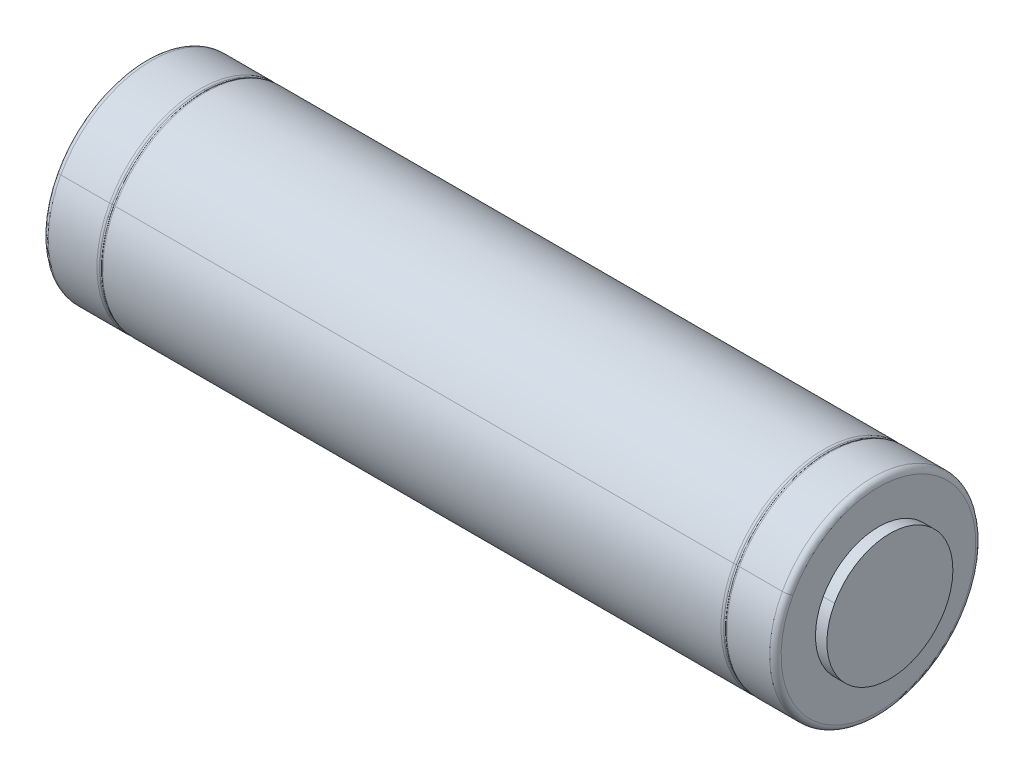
ISO-10303-21;
HEADER;
FILE_DESCRIPTION(('STEP AP214'),'2;1');
FILE_NAME('part.step','',(''),(''),'','','');
FILE_SCHEMA(('AUTOMOTIVE_DESIGN { 1 0 10303 214 1 1 1 1 }'));
ENDSEC;
DATA;
#1=APPLICATION_CONTEXT('core data for automotive mechanical design processes');
#2=APPLICATION_PROTOCOL_DEFINITION('international standard','automotive_design',2000,#1);
#3=PRODUCT_CONTEXT('',#1,'mechanical');
#4=PRODUCT('Part','Part','',(#3));
#5=PRODUCT_RELATED_PRODUCT_CATEGORY('part','',(#4));
#6=PRODUCT_DEFINITION_FORMATION('','',#4);
#7=PRODUCT_DEFINITION_CONTEXT('part definition',#1,'design');
#8=PRODUCT_DEFINITION('design','',#6,#7);
#9=PRODUCT_DEFINITION_SHAPE('','',#8);
#10=(LENGTH_UNIT() NAMED_UNIT(*) SI_UNIT(.MILLI.,.METRE.));
#11=(NAMED_UNIT(*) PLANE_ANGLE_UNIT() SI_UNIT($,.RADIAN.));
#12=(NAMED_UNIT(*) SI_UNIT($,.STERADIAN.) SOLID_ANGLE_UNIT());
#13=UNCERTAINTY_MEASURE_WITH_UNIT(LENGTH_MEASURE(1.E-05),#10,'distance_accuracy_value','');
#14=(GEOMETRIC_REPRESENTATION_CONTEXT(3) GLOBAL_UNCERTAINTY_ASSIGNED_CONTEXT((#13)) GLOBAL_UNIT_ASSIGNED_CONTEXT((#10,
#11,#12)) REPRESENTATION_CONTEXT('',''));
#15=CARTESIAN_POINT('',(0.,0.,0.));
#16=DIRECTION('',(0.,0.,1.));
#17=DIRECTION('',(1.,0.,0.));
#18=AXIS2_PLACEMENT_3D('',#15,#16,#17);
#19=CARTESIAN_POINT('',(0.,0.,0.));
#20=DIRECTION('',(-1.,0.,0.));
#21=DIRECTION('',(0.,0.,1.));
#22=AXIS2_PLACEMENT_3D('',#19,#20,#21);
#23=PLANE('',#22);
#24=CARTESIAN_POINT('',(0.,0.,0.));
#25=DIRECTION('',(-1.,0.,0.));
#26=DIRECTION('',(0.,-1.,0.));
#27=AXIS2_PLACEMENT_3D('',#24,#25,#26);
#28=CIRCLE('',#27,5.5);
#29=CARTESIAN_POINT('',(0.,2.63684046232,4.8267040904));
#30=VERTEX_POINT('',#29);
#31=CARTESIAN_POINT('',(0.,-2.63684046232,-4.8267040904));
#32=VERTEX_POINT('',#31);
#33=EDGE_CURVE('E311',#30,#32,#28,.T.);
#34=ORIENTED_EDGE('',*,*,#33,.F.);
#35=CARTESIAN_POINT('',(0.,0.,0.));
#36=DIRECTION('',(-1.,0.,0.));
#37=DIRECTION('',(0.,-1.,0.));
#38=AXIS2_PLACEMENT_3D('',#35,#36,#37);
#39=CIRCLE('',#38,5.5);
#40=EDGE_CURVE('E11',#32,#30,#39,.T.);
#41=ORIENTED_EDGE('',*,*,#40,.F.);
#42=EDGE_LOOP('',(#34,#41));
#43=FACE_BOUND('',#42,.T.);
#44=ADVANCED_FACE('F16',(#43),#23,.F.);
#45=CARTESIAN_POINT('',(-1.,0.,5.5));
#46=DIRECTION('',(-1.,0.,0.));
#47=DIRECTION('',(0.,0.,1.));
#48=AXIS2_PLACEMENT_3D('',#45,#46,#47);
#49=PLANE('',#48);
#50=CARTESIAN_POINT('',(-1.,0.,0.));
#51=DIRECTION('',(-1.,0.,0.));
#52=DIRECTION('',(0.,-1.,0.));
#53=AXIS2_PLACEMENT_3D('',#50,#51,#52);
#54=CIRCLE('',#53,5.5);
#55=CARTESIAN_POINT('',(-1.,-2.63684046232,-4.8267040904));
#56=VERTEX_POINT('',#55);
#57=CARTESIAN_POINT('',(-1.,2.63684046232,4.8267040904));
#58=VERTEX_POINT('',#57);
#59=EDGE_CURVE('E27',#56,#58,#54,.T.);
#60=ORIENTED_EDGE('',*,*,#59,.T.);
#61=CARTESIAN_POINT('',(-1.,0.,0.));
#62=DIRECTION('',(-1.,0.,0.));
#63=DIRECTION('',(0.,-1.,0.));
#64=AXIS2_PLACEMENT_3D('',#61,#62,#63);
#65=CIRCLE('',#64,5.5);
#66=EDGE_CURVE('E199',#58,#56,#65,.T.);
#67=ORIENTED_EDGE('',*,*,#66,.T.);
#68=EDGE_LOOP('',(#60,#67));
#69=FACE_BOUND('',#68,.T.);
#70=CARTESIAN_POINT('',(-1.,0.,0.));
#71=DIRECTION('',(-1.,0.,0.));
#72=DIRECTION('',(0.,-1.,0.));
#73=AXIS2_PLACEMENT_3D('',#70,#71,#72);
#74=CIRCLE('',#73,8.5);
#75=CARTESIAN_POINT('',(-1.,4.07511707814,7.45945177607));
#76=VERTEX_POINT('',#75);
#77=CARTESIAN_POINT('',(-1.,-4.07511707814,-7.45945177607));
#78=VERTEX_POINT('',#77);
#79=EDGE_CURVE('E249',#76,#78,#74,.T.);
#80=ORIENTED_EDGE('',*,*,#79,.F.);
#81=CARTESIAN_POINT('',(-1.,0.,0.));
#82=DIRECTION('',(-1.,0.,0.));
#83=DIRECTION('',(0.,-1.,0.));
#84=AXIS2_PLACEMENT_3D('',#81,#82,#83);
#85=CIRCLE('',#84,8.5);
#86=EDGE_CURVE('E196',#78,#76,#85,.T.);
#87=ORIENTED_EDGE('',*,*,#86,.F.);
#88=EDGE_LOOP('',(#80,#87));
#89=FACE_BOUND('',#88,.T.);
#90=ADVANCED_FACE('F348',(#69,#89),#49,.F.);
#91=CARTESIAN_POINT('',(-65.,0.,9.));
#92=DIRECTION('',(-1.,0.,0.));
#93=DIRECTION('',(0.,0.,1.));
#94=AXIS2_PLACEMENT_3D('',#91,#92,#93);
#95=PLANE('',#94);
#96=CARTESIAN_POINT('',(-65.,0.,0.));
#97=DIRECTION('',(-1.,0.,0.));
#98=DIRECTION('',(0.,-1.,0.));
#99=AXIS2_PLACEMENT_3D('',#96,#97,#98);
#100=CIRCLE('',#99,8.5);
#101=CARTESIAN_POINT('',(-65.,-4.07511707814,-7.45945177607));
#102=VERTEX_POINT('',#101);
#103=CARTESIAN_POINT('',(-65.,4.07511707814,7.45945177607));
#104=VERTEX_POINT('',#103);
#105=EDGE_CURVE('E291',#102,#104,#100,.T.);
#106=ORIENTED_EDGE('',*,*,#105,.T.);
#107=CARTESIAN_POINT('',(-65.,0.,0.));
#108=DIRECTION('',(-1.,0.,0.));
#109=DIRECTION('',(0.,-1.,0.));
#110=AXIS2_PLACEMENT_3D('',#107,#108,#109);
#111=CIRCLE('',#110,8.5);
#112=EDGE_CURVE('E267',#104,#102,#111,.T.);
#113=ORIENTED_EDGE('',*,*,#112,.T.);
#114=EDGE_LOOP('',(#106,#113));
#115=FACE_BOUND('',#114,.T.);
#116=ADVANCED_FACE('F353',(#115),#95,.T.);
#117=CARTESIAN_POINT('',(-32.5,0.,0.));
#118=DIRECTION('',(-1.,0.,0.));
#119=DIRECTION('',(0.,0.479425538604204,0.877582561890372));
#120=AXIS2_PLACEMENT_3D('',#117,#118,#119);
#121=CYLINDRICAL_SURFACE('',#120,5.5);
#122=ORIENTED_EDGE('',*,*,#59,.F.);
#123=DIRECTION('',(1.,0.,0.));
#124=VECTOR('',#123,1.);
#125=CARTESIAN_POINT('',(-0.5,-2.63684046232,-4.8267040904));
#126=LINE('',#125,#124);
#127=EDGE_CURVE('E271',#56,#32,#126,.T.);
#128=ORIENTED_EDGE('',*,*,#127,.T.);
#129=ORIENTED_EDGE('',*,*,#40,.T.);
#130=DIRECTION('',(1.,0.,0.));
#131=VECTOR('',#130,1.);
#132=CARTESIAN_POINT('',(-0.5,2.63684046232,4.8267040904));
#133=LINE('',#132,#131);
#134=EDGE_CURVE('E203',#58,#30,#133,.T.);
#135=ORIENTED_EDGE('',*,*,#134,.F.);
#136=EDGE_LOOP('',(#122,#128,#129,#135));
#137=FACE_BOUND('',#136,.T.);
#138=ADVANCED_FACE('F342',(#137),#121,.T.);
#139=CARTESIAN_POINT('',(-32.5,0.,0.));
#140=DIRECTION('',(-1.,0.,0.));
#141=DIRECTION('',(0.,0.479425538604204,0.877582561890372));
#142=AXIS2_PLACEMENT_3D('',#139,#140,#141);
#143=CYLINDRICAL_SURFACE('',#142,5.5);
#144=ORIENTED_EDGE('',*,*,#66,.F.);
#145=ORIENTED_EDGE('',*,*,#134,.T.);
#146=ORIENTED_EDGE('',*,*,#33,.T.);
#147=ORIENTED_EDGE('',*,*,#127,.F.);
#148=EDGE_LOOP('',(#144,#145,#146,#147));
#149=FACE_BOUND('',#148,.T.);
#150=ADVANCED_FACE('F346',(#149),#143,.T.);
#151=CARTESIAN_POINT('',(-1.5,0.,0.));
#152=DIRECTION('',(-1.,0.,0.));
#153=DIRECTION('',(0.,-0.479425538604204,-0.877582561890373));
#154=AXIS2_PLACEMENT_3D('',#151,#152,#153);
#155=TOROIDAL_SURFACE('',#154,8.5,0.5);
#156=CARTESIAN_POINT('',(-1.5,-4.07511707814,-7.45945177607));
#157=DIRECTION('',(0.,-0.877582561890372,0.479425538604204));
#158=DIRECTION('',(1.,0.,0.));
#159=AXIS2_PLACEMENT_3D('',#156,#157,#158);
#160=CIRCLE('',#159,0.5);
#161=CARTESIAN_POINT('',(-1.5,-4.31482984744,-7.89824305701));
#162=VERTEX_POINT('',#161);
#163=EDGE_CURVE('E302',#162,#78,#160,.T.);
#164=ORIENTED_EDGE('',*,*,#163,.T.);
#165=ORIENTED_EDGE('',*,*,#86,.T.);
#166=CARTESIAN_POINT('',(-1.5,4.07511707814,7.45945177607));
#167=DIRECTION('',(0.,0.877582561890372,-0.479425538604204));
#168=DIRECTION('',(1.,0.,0.));
#169=AXIS2_PLACEMENT_3D('',#166,#167,#168);
#170=CIRCLE('',#169,0.5);
#171=CARTESIAN_POINT('',(-1.5,4.31482984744,7.89824305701));
#172=VERTEX_POINT('',#171);
#173=EDGE_CURVE('E245',#172,#76,#170,.T.);
#174=ORIENTED_EDGE('',*,*,#173,.F.);
#175=CARTESIAN_POINT('',(-1.5,0.,0.));
#176=DIRECTION('',(-1.,0.,0.));
#177=DIRECTION('',(0.,-1.,0.));
#178=AXIS2_PLACEMENT_3D('',#175,#176,#177);
#179=CIRCLE('',#178,9.);
#180=EDGE_CURVE('E200',#162,#172,#179,.T.);
#181=ORIENTED_EDGE('',*,*,#180,.F.);
#182=EDGE_LOOP('',(#164,#165,#174,#181));
#183=FACE_BOUND('',#182,.T.);
#184=ADVANCED_FACE('F389',(#183),#155,.T.);
#185=CARTESIAN_POINT('',(-32.5,0.,0.));
#186=DIRECTION('',(-1.,0.,0.));
#187=DIRECTION('',(0.,0.479425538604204,0.877582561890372));
#188=AXIS2_PLACEMENT_3D('',#185,#186,#187);
#189=CYLINDRICAL_SURFACE('',#188,9.);
#190=DIRECTION('',(1.,0.,0.));
#191=VECTOR('',#190,1.);
#192=CARTESIAN_POINT('',(-33.,4.31482984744,7.89824305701));
#193=LINE('',#192,#191);
#194=CARTESIAN_POINT('',(-5.25,4.31482984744,7.89824305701));
#195=VERTEX_POINT('',#194);
#196=EDGE_CURVE('E214',#195,#172,#193,.T.);
#197=ORIENTED_EDGE('',*,*,#196,.F.);
#198=CARTESIAN_POINT('',(-5.25,0.,0.));
#199=DIRECTION('',(-1.,0.,0.));
#200=DIRECTION('',(0.,-1.,0.));
#201=AXIS2_PLACEMENT_3D('',#198,#199,#200);
#202=CIRCLE('',#201,9.);
#203=CARTESIAN_POINT('',(-5.25,-4.31482984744,-7.89824305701));
#204=VERTEX_POINT('',#203);
#205=EDGE_CURVE('E215',#204,#195,#202,.T.);
#206=ORIENTED_EDGE('',*,*,#205,.F.);
#207=DIRECTION('',(1.,0.,0.));
#208=VECTOR('',#207,1.);
#209=CARTESIAN_POINT('',(-33.,-4.31482984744,-7.89824305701));
#210=LINE('',#209,#208);
#211=EDGE_CURVE('E211',#204,#162,#210,.T.);
#212=ORIENTED_EDGE('',*,*,#211,.T.);
#213=ORIENTED_EDGE('',*,*,#180,.T.);
#214=EDGE_LOOP('',(#197,#206,#212,#213));
#215=FACE_BOUND('',#214,.T.);
#216=ADVANCED_FACE('F358',(#215),#189,.T.);
#217=CARTESIAN_POINT('',(-1.5,0.,0.));
#218=DIRECTION('',(-1.,0.,0.));
#219=DIRECTION('',(0.,0.479425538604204,0.877582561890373));
#220=AXIS2_PLACEMENT_3D('',#217,#218,#219);
#221=TOROIDAL_SURFACE('',#220,8.5,0.5);
#222=ORIENTED_EDGE('',*,*,#173,.T.);
#223=ORIENTED_EDGE('',*,*,#79,.T.);
#224=ORIENTED_EDGE('',*,*,#163,.F.);
#225=CARTESIAN_POINT('',(-1.5,0.,0.));
#226=DIRECTION('',(-1.,0.,0.));
#227=DIRECTION('',(0.,-1.,0.));
#228=AXIS2_PLACEMENT_3D('',#225,#226,#227);
#229=CIRCLE('',#228,9.);
#230=EDGE_CURVE('E250',#172,#162,#229,.T.);
#231=ORIENTED_EDGE('',*,*,#230,.F.);
#232=EDGE_LOOP('',(#222,#223,#224,#231));
#233=FACE_BOUND('',#232,.T.);
#234=ADVANCED_FACE('F679',(#233),#221,.T.);
#235=CARTESIAN_POINT('',(-32.5,0.,0.));
#236=DIRECTION('',(-1.,0.,0.));
#237=DIRECTION('',(0.,0.479425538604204,0.877582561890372));
#238=AXIS2_PLACEMENT_3D('',#235,#236,#237);
#239=CYLINDRICAL_SURFACE('',#238,9.);
#240=ORIENTED_EDGE('',*,*,#211,.F.);
#241=CARTESIAN_POINT('',(-5.25,0.,0.));
#242=DIRECTION('',(-1.,0.,0.));
#243=DIRECTION('',(0.,-1.,0.));
#244=AXIS2_PLACEMENT_3D('',#241,#242,#243);
#245=CIRCLE('',#244,9.);
#246=EDGE_CURVE('E219',#195,#204,#245,.T.);
#247=ORIENTED_EDGE('',*,*,#246,.F.);
#248=ORIENTED_EDGE('',*,*,#196,.T.);
#249=ORIENTED_EDGE('',*,*,#230,.T.);
#250=EDGE_LOOP('',(#240,#247,#248,#249));
#251=FACE_BOUND('',#250,.T.);
#252=ADVANCED_FACE('F658',(#251),#239,.T.);
#253=CARTESIAN_POINT('',(-5.25,0.,0.));
#254=DIRECTION('',(-1.,0.,0.));
#255=DIRECTION('',(0.,0.479425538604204,0.877582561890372));
#256=AXIS2_PLACEMENT_3D('',#253,#254,#255);
#257=TOROIDAL_SURFACE('',#256,8.75,0.25);
#258=CARTESIAN_POINT('',(-5.42857142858,0.,0.));
#259=DIRECTION('',(-1.,0.,0.));
#260=DIRECTION('',(0.,-1.,0.));
#261=AXIS2_PLACEMENT_3D('',#258,#259,#260);
#262=CIRCLE('',#261,8.92496355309);
#263=CARTESIAN_POINT('',(-5.42857142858,-4.27885545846,-7.83239237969));
#264=VERTEX_POINT('',#263);
#265=CARTESIAN_POINT('',(-5.42857142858,4.27885545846,7.83239237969));
#266=VERTEX_POINT('',#265);
#267=EDGE_CURVE('E153',#264,#266,#262,.T.);
#268=ORIENTED_EDGE('',*,*,#267,.F.);
#269=CARTESIAN_POINT('',(-5.25,-4.19497346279,-7.67884741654));
#270=DIRECTION('',(0.,-0.877582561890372,0.479425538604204));
#271=DIRECTION('',(1.,0.,0.));
#272=AXIS2_PLACEMENT_3D('',#269,#270,#271);
#273=CIRCLE('',#272,0.25);
#274=EDGE_CURVE('E225',#264,#204,#273,.T.);
#275=ORIENTED_EDGE('',*,*,#274,.T.);
#276=ORIENTED_EDGE('',*,*,#205,.T.);
#277=CARTESIAN_POINT('',(-5.25,4.19497346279,7.67884741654));
#278=DIRECTION('',(0.,0.877582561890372,-0.479425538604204));
#279=DIRECTION('',(1.,0.,0.));
#280=AXIS2_PLACEMENT_3D('',#277,#278,#279);
#281=CIRCLE('',#280,0.25);
#282=EDGE_CURVE('E216',#266,#195,#281,.T.);
#283=ORIENTED_EDGE('',*,*,#282,.F.);
#284=EDGE_LOOP('',(#268,#275,#276,#283));
#285=FACE_BOUND('',#284,.T.);
#286=ADVANCED_FACE('F653',(#285),#257,.T.);
#287=CARTESIAN_POINT('',(-5.25,0.,0.));
#288=DIRECTION('',(-1.,0.,0.));
#289=DIRECTION('',(0.,0.479425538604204,0.877582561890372));
#290=AXIS2_PLACEMENT_3D('',#287,#288,#289);
#291=TOROIDAL_SURFACE('',#290,8.75,0.25);
#292=CARTESIAN_POINT('',(-5.42857142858,0.,0.));
#293=DIRECTION('',(-1.,0.,0.));
#294=DIRECTION('',(0.,-1.,0.));
#295=AXIS2_PLACEMENT_3D('',#292,#293,#294);
#296=CIRCLE('',#295,8.92496355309);
#297=EDGE_CURVE('E159',#266,#264,#296,.T.);
#298=ORIENTED_EDGE('',*,*,#297,.F.);
#299=ORIENTED_EDGE('',*,*,#282,.T.);
#300=ORIENTED_EDGE('',*,*,#246,.T.);
#301=ORIENTED_EDGE('',*,*,#274,.F.);
#302=EDGE_LOOP('',(#298,#299,#300,#301));
#303=FACE_BOUND('',#302,.T.);
#304=ADVANCED_FACE('F379',(#303),#291,.T.);
#305=CARTESIAN_POINT('',(-5.5,0.,0.));
#306=DIRECTION('',(-1.,0.,0.));
#307=DIRECTION('',(0.,0.479425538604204,0.877582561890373));
#308=AXIS2_PLACEMENT_3D('',#305,#306,#307);
#309=TOROIDAL_SURFACE('',#308,8.99494897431,0.1);
#310=CARTESIAN_POINT('',(-5.57142857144,0.,0.));
#311=DIRECTION('',(-1.,0.,0.));
#312=DIRECTION('',(0.,-1.,0.));
#313=AXIS2_PLACEMENT_3D('',#310,#311,#312);
#314=CIRCLE('',#313,8.92496355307);
#315=CARTESIAN_POINT('',(-5.57142857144,-4.27885545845,-7.83239237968));
#316=VERTEX_POINT('',#315);
#317=CARTESIAN_POINT('',(-5.57142857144,4.27885545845,7.83239237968));
#318=VERTEX_POINT('',#317);
#319=EDGE_CURVE('E150',#316,#318,#314,.T.);
#320=ORIENTED_EDGE('',*,*,#319,.F.);
#321=CARTESIAN_POINT('',(-5.5,-4.31240825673,-7.89381036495));
#322=DIRECTION('',(0.,0.877582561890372,-0.479425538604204));
#323=DIRECTION('',(1.,0.,0.));
#324=AXIS2_PLACEMENT_3D('',#321,#322,#323);
#325=CIRCLE('',#324,0.1);
#326=EDGE_CURVE('E173',#316,#264,#325,.T.);
#327=ORIENTED_EDGE('',*,*,#326,.T.);
#328=ORIENTED_EDGE('',*,*,#267,.T.);
#329=CARTESIAN_POINT('',(-5.5,4.31240825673,7.89381036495));
#330=DIRECTION('',(0.,-0.877582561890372,0.479425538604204));
#331=DIRECTION('',(1.,0.,0.));
#332=AXIS2_PLACEMENT_3D('',#329,#330,#331);
#333=CIRCLE('',#332,0.1);
#334=EDGE_CURVE('E146',#318,#266,#333,.T.);
#335=ORIENTED_EDGE('',*,*,#334,.F.);
#336=EDGE_LOOP('',(#320,#327,#328,#335));
#337=FACE_BOUND('',#336,.T.);
#338=ADVANCED_FACE('F148',(#337),#309,.F.);
#339=CARTESIAN_POINT('',(-5.5,0.,0.));
#340=DIRECTION('',(-1.,0.,0.));
#341=DIRECTION('',(0.,0.479425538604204,0.877582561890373));
#342=AXIS2_PLACEMENT_3D('',#339,#340,#341);
#343=TOROIDAL_SURFACE('',#342,8.99494897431,0.1);
#344=CARTESIAN_POINT('',(-5.57142857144,0.,0.));
#345=DIRECTION('',(-1.,0.,0.));
#346=DIRECTION('',(0.,-1.,0.));
#347=AXIS2_PLACEMENT_3D('',#344,#345,#346);
#348=CIRCLE('',#347,8.92496355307);
#349=EDGE_CURVE('E171',#318,#316,#348,.T.);
#350=ORIENTED_EDGE('',*,*,#349,.F.);
#351=ORIENTED_EDGE('',*,*,#334,.T.);
#352=ORIENTED_EDGE('',*,*,#297,.T.);
#353=ORIENTED_EDGE('',*,*,#326,.F.);
#354=EDGE_LOOP('',(#350,#351,#352,#353));
#355=FACE_BOUND('',#354,.T.);
#356=ADVANCED_FACE('F172',(#355),#343,.F.);
#357=CARTESIAN_POINT('',(-5.75,0.,0.));
#358=DIRECTION('',(-1.,0.,0.));
#359=DIRECTION('',(0.,0.479425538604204,0.877582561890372));
#360=AXIS2_PLACEMENT_3D('',#357,#358,#359);
#361=TOROIDAL_SURFACE('',#360,8.75,0.25);
#362=CARTESIAN_POINT('',(-5.75,0.,0.));
#363=DIRECTION('',(-1.,0.,0.));
#364=DIRECTION('',(0.,-1.,0.));
#365=AXIS2_PLACEMENT_3D('',#362,#363,#364);
#366=CIRCLE('',#365,9.);
#367=CARTESIAN_POINT('',(-5.75,-4.31482984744,-7.89824305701));
#368=VERTEX_POINT('',#367);
#369=CARTESIAN_POINT('',(-5.75,4.31482984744,7.89824305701));
#370=VERTEX_POINT('',#369);
#371=EDGE_CURVE('E183',#368,#370,#366,.T.);
#372=ORIENTED_EDGE('',*,*,#371,.F.);
#373=CARTESIAN_POINT('',(-5.75,-4.19497346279,-7.67884741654));
#374=DIRECTION('',(0.,-0.877582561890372,0.479425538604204));
#375=DIRECTION('',(1.,0.,0.));
#376=AXIS2_PLACEMENT_3D('',#373,#374,#375);
#377=CIRCLE('',#376,0.25);
#378=EDGE_CURVE('E167',#368,#316,#377,.T.);
#379=ORIENTED_EDGE('',*,*,#378,.T.);
#380=ORIENTED_EDGE('',*,*,#319,.T.);
#381=CARTESIAN_POINT('',(-5.75,4.19497346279,7.67884741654));
#382=DIRECTION('',(0.,0.877582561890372,-0.479425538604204));
#383=DIRECTION('',(1.,0.,0.));
#384=AXIS2_PLACEMENT_3D('',#381,#382,#383);
#385=CIRCLE('',#384,0.25);
#386=EDGE_CURVE('E165',#370,#318,#385,.T.);
#387=ORIENTED_EDGE('',*,*,#386,.F.);
#388=EDGE_LOOP('',(#372,#379,#380,#387));
#389=FACE_BOUND('',#388,.T.);
#390=ADVANCED_FACE('F163',(#389),#361,.T.);
#391=CARTESIAN_POINT('',(-5.75,0.,0.));
#392=DIRECTION('',(-1.,0.,0.));
#393=DIRECTION('',(0.,0.479425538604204,0.877582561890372));
#394=AXIS2_PLACEMENT_3D('',#391,#392,#393);
#395=TOROIDAL_SURFACE('',#394,8.75,0.25);
#396=CARTESIAN_POINT('',(-5.75,0.,0.));
#397=DIRECTION('',(-1.,0.,0.));
#398=DIRECTION('',(0.,-1.,0.));
#399=AXIS2_PLACEMENT_3D('',#396,#397,#398);
#400=CIRCLE('',#399,9.);
#401=EDGE_CURVE('E180',#370,#368,#400,.T.);
#402=ORIENTED_EDGE('',*,*,#401,.F.);
#403=ORIENTED_EDGE('',*,*,#386,.T.);
#404=ORIENTED_EDGE('',*,*,#349,.T.);
#405=ORIENTED_EDGE('',*,*,#378,.F.);
#406=EDGE_LOOP('',(#402,#403,#404,#405));
#407=FACE_BOUND('',#406,.T.);
#408=ADVANCED_FACE('F178',(#407),#395,.T.);
#409=CARTESIAN_POINT('',(-32.5,0.,0.));
#410=DIRECTION('',(-1.,0.,0.));
#411=DIRECTION('',(0.,0.479425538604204,0.877582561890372));
#412=AXIS2_PLACEMENT_3D('',#409,#410,#411);
#413=CYLINDRICAL_SURFACE('',#412,9.);
#414=CARTESIAN_POINT('',(-59.75,0.,0.));
#415=DIRECTION('',(-1.,0.,0.));
#416=DIRECTION('',(0.,-1.,0.));
#417=AXIS2_PLACEMENT_3D('',#414,#415,#416);
#418=CIRCLE('',#417,9.);
#419=CARTESIAN_POINT('',(-59.75,-4.31482984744,-7.89824305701));
#420=VERTEX_POINT('',#419);
#421=CARTESIAN_POINT('',(-59.75,4.31482984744,7.89824305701));
#422=VERTEX_POINT('',#421);
#423=EDGE_CURVE('E237',#420,#422,#418,.T.);
#424=ORIENTED_EDGE('',*,*,#423,.F.);
#425=DIRECTION('',(1.,0.,0.));
#426=VECTOR('',#425,1.);
#427=CARTESIAN_POINT('',(-33.,-4.31482984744,-7.89824305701));
#428=LINE('',#427,#426);
#429=EDGE_CURVE('E190',#420,#368,#428,.T.);
#430=ORIENTED_EDGE('',*,*,#429,.T.);
#431=ORIENTED_EDGE('',*,*,#371,.T.);
#432=DIRECTION('',(1.,0.,0.));
#433=VECTOR('',#432,1.);
#434=CARTESIAN_POINT('',(-33.,4.31482984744,7.89824305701));
#435=LINE('',#434,#433);
#436=EDGE_CURVE('E235',#422,#370,#435,.T.);
#437=ORIENTED_EDGE('',*,*,#436,.F.);
#438=EDGE_LOOP('',(#424,#430,#431,#437));
#439=FACE_BOUND('',#438,.T.);
#440=ADVANCED_FACE('F374',(#439),#413,.T.);
#441=CARTESIAN_POINT('',(-32.5,0.,0.));
#442=DIRECTION('',(-1.,0.,0.));
#443=DIRECTION('',(0.,0.479425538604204,0.877582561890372));
#444=AXIS2_PLACEMENT_3D('',#441,#442,#443);
#445=CYLINDRICAL_SURFACE('',#444,9.);
#446=CARTESIAN_POINT('',(-59.75,0.,0.));
#447=DIRECTION('',(-1.,0.,0.));
#448=DIRECTION('',(0.,-1.,0.));
#449=AXIS2_PLACEMENT_3D('',#446,#447,#448);
#450=CIRCLE('',#449,9.);
#451=EDGE_CURVE('E20',#422,#420,#450,.T.);
#452=ORIENTED_EDGE('',*,*,#451,.F.);
#453=ORIENTED_EDGE('',*,*,#436,.T.);
#454=ORIENTED_EDGE('',*,*,#401,.T.);
#455=ORIENTED_EDGE('',*,*,#429,.F.);
#456=EDGE_LOOP('',(#452,#453,#454,#455));
#457=FACE_BOUND('',#456,.T.);
#458=ADVANCED_FACE('F698',(#457),#445,.T.);
#459=CARTESIAN_POINT('',(-59.75,0.,0.));
#460=DIRECTION('',(-1.,0.,0.));
#461=DIRECTION('',(0.,0.479425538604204,0.877582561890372));
#462=AXIS2_PLACEMENT_3D('',#459,#460,#461);
#463=TOROIDAL_SURFACE('',#462,8.75,0.25);
#464=CARTESIAN_POINT('',(-59.9285714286,0.,0.));
#465=DIRECTION('',(-1.,0.,0.));
#466=DIRECTION('',(0.,-1.,0.));
#467=AXIS2_PLACEMENT_3D('',#464,#465,#466);
#468=CIRCLE('',#467,8.92496355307);
#469=CARTESIAN_POINT('',(-59.9285714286,-4.27885545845,-7.83239237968));
#470=VERTEX_POINT('',#469);
#471=CARTESIAN_POINT('',(-59.9285714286,4.27885545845,7.83239237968));
#472=VERTEX_POINT('',#471);
#473=EDGE_CURVE('E209',#470,#472,#468,.T.);
#474=ORIENTED_EDGE('',*,*,#473,.F.);
#475=CARTESIAN_POINT('',(-59.75,-4.19497346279,-7.67884741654));
#476=DIRECTION('',(0.,-0.877582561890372,0.479425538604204));
#477=DIRECTION('',(1.,0.,0.));
#478=AXIS2_PLACEMENT_3D('',#475,#476,#477);
#479=CIRCLE('',#478,0.25);
#480=EDGE_CURVE('E240',#470,#420,#479,.T.);
#481=ORIENTED_EDGE('',*,*,#480,.T.);
#482=ORIENTED_EDGE('',*,*,#423,.T.);
#483=CARTESIAN_POINT('',(-59.75,4.19497346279,7.67884741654));
#484=DIRECTION('',(0.,0.877582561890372,-0.479425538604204));
#485=DIRECTION('',(1.,0.,0.));
#486=AXIS2_PLACEMENT_3D('',#483,#484,#485);
#487=CIRCLE('',#486,0.25);
#488=EDGE_CURVE('E194',#472,#422,#487,.T.);
#489=ORIENTED_EDGE('',*,*,#488,.F.);
#490=EDGE_LOOP('',(#474,#481,#482,#489));
#491=FACE_BOUND('',#490,.T.);
#492=ADVANCED_FACE('F383',(#491),#463,.T.);
#493=CARTESIAN_POINT('',(-59.75,0.,0.));
#494=DIRECTION('',(-1.,0.,0.));
#495=DIRECTION('',(0.,0.479425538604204,0.877582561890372));
#496=AXIS2_PLACEMENT_3D('',#493,#494,#495);
#497=TOROIDAL_SURFACE('',#496,8.75,0.25);
#498=CARTESIAN_POINT('',(-59.9285714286,0.,0.));
#499=DIRECTION('',(-1.,0.,0.));
#500=DIRECTION('',(0.,-1.,0.));
#501=AXIS2_PLACEMENT_3D('',#498,#499,#500);
#502=CIRCLE('',#501,8.92496355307);
#503=EDGE_CURVE('E210',#472,#470,#502,.T.);
#504=ORIENTED_EDGE('',*,*,#503,.F.);
#505=ORIENTED_EDGE('',*,*,#488,.T.);
#506=ORIENTED_EDGE('',*,*,#451,.T.);
#507=ORIENTED_EDGE('',*,*,#480,.F.);
#508=EDGE_LOOP('',(#504,#505,#506,#507));
#509=FACE_BOUND('',#508,.T.);
#510=ADVANCED_FACE('F404',(#509),#497,.T.);
#511=CARTESIAN_POINT('',(-60.,0.,0.));
#512=DIRECTION('',(-1.,0.,0.));
#513=DIRECTION('',(0.,0.479425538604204,0.877582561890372));
#514=AXIS2_PLACEMENT_3D('',#511,#512,#513);
#515=TOROIDAL_SURFACE('',#514,8.99494897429,0.1);
#516=CARTESIAN_POINT('',(-60.0714285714,0.,0.));
#517=DIRECTION('',(-1.,0.,0.));
#518=DIRECTION('',(0.,-1.,0.));
#519=AXIS2_PLACEMENT_3D('',#516,#517,#518);
#520=CIRCLE('',#519,8.92496355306);
#521=CARTESIAN_POINT('',(-60.0714285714,-4.27885545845,-7.83239237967));
#522=VERTEX_POINT('',#521);
#523=CARTESIAN_POINT('',(-60.0714285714,4.27885545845,7.83239237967));
#524=VERTEX_POINT('',#523);
#525=EDGE_CURVE('E295',#522,#524,#520,.T.);
#526=ORIENTED_EDGE('',*,*,#525,.F.);
#527=CARTESIAN_POINT('',(-60.,-4.31240825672,-7.89381036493));
#528=DIRECTION('',(0.,0.877582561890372,-0.479425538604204));
#529=DIRECTION('',(1.,0.,0.));
#530=AXIS2_PLACEMENT_3D('',#527,#528,#529);
#531=CIRCLE('',#530,0.1);
#532=EDGE_CURVE('E205',#522,#470,#531,.T.);
#533=ORIENTED_EDGE('',*,*,#532,.T.);
#534=ORIENTED_EDGE('',*,*,#473,.T.);
#535=CARTESIAN_POINT('',(-60.,4.31240825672,7.89381036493));
#536=DIRECTION('',(0.,-0.877582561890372,0.479425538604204));
#537=DIRECTION('',(1.,0.,0.));
#538=AXIS2_PLACEMENT_3D('',#535,#536,#537);
#539=CIRCLE('',#538,0.1);
#540=EDGE_CURVE('E284',#524,#472,#539,.T.);
#541=ORIENTED_EDGE('',*,*,#540,.F.);
#542=EDGE_LOOP('',(#526,#533,#534,#541));
#543=FACE_BOUND('',#542,.T.);
#544=ADVANCED_FACE('F402',(#543),#515,.F.);
#545=CARTESIAN_POINT('',(-60.,0.,0.));
#546=DIRECTION('',(-1.,0.,0.));
#547=DIRECTION('',(0.,0.479425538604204,0.877582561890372));
#548=AXIS2_PLACEMENT_3D('',#545,#546,#547);
#549=TOROIDAL_SURFACE('',#548,8.99494897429,0.1);
#550=CARTESIAN_POINT('',(-60.0714285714,0.,0.));
#551=DIRECTION('',(-1.,0.,0.));
#552=DIRECTION('',(0.,-1.,0.));
#553=AXIS2_PLACEMENT_3D('',#550,#551,#552);
#554=CIRCLE('',#553,8.92496355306);
#555=EDGE_CURVE('E272',#524,#522,#554,.T.);
#556=ORIENTED_EDGE('',*,*,#555,.F.);
#557=ORIENTED_EDGE('',*,*,#540,.T.);
#558=ORIENTED_EDGE('',*,*,#503,.T.);
#559=ORIENTED_EDGE('',*,*,#532,.F.);
#560=EDGE_LOOP('',(#556,#557,#558,#559));
#561=FACE_BOUND('',#560,.T.);
#562=ADVANCED_FACE('F18',(#561),#549,.F.);
#563=CARTESIAN_POINT('',(-60.25,0.,0.));
#564=DIRECTION('',(-1.,0.,0.));
#565=DIRECTION('',(0.,0.479425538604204,0.877582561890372));
#566=AXIS2_PLACEMENT_3D('',#563,#564,#565);
#567=TOROIDAL_SURFACE('',#566,8.75,0.25);
#568=CARTESIAN_POINT('',(-60.25,0.,0.));
#569=DIRECTION('',(-1.,0.,0.));
#570=DIRECTION('',(0.,-1.,0.));
#571=AXIS2_PLACEMENT_3D('',#568,#569,#570);
#572=CIRCLE('',#571,9.);
#573=CARTESIAN_POINT('',(-60.25,-4.31482984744,-7.89824305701));
#574=VERTEX_POINT('',#573);
#575=CARTESIAN_POINT('',(-60.25,4.31482984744,7.89824305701));
#576=VERTEX_POINT('',#575);
#577=EDGE_CURVE('E278',#574,#576,#572,.T.);
#578=ORIENTED_EDGE('',*,*,#577,.F.);
#579=CARTESIAN_POINT('',(-60.25,-4.19497346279,-7.67884741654));
#580=DIRECTION('',(0.,-0.877582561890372,0.479425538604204));
#581=DIRECTION('',(1.,0.,0.));
#582=AXIS2_PLACEMENT_3D('',#579,#580,#581);
#583=CIRCLE('',#582,0.25);
#584=EDGE_CURVE('E276',#574,#522,#583,.T.);
#585=ORIENTED_EDGE('',*,*,#584,.T.);
#586=ORIENTED_EDGE('',*,*,#525,.T.);
#587=CARTESIAN_POINT('',(-60.25,4.19497346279,7.67884741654));
#588=DIRECTION('',(0.,0.877582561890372,-0.479425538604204));
#589=DIRECTION('',(1.,0.,0.));
#590=AXIS2_PLACEMENT_3D('',#587,#588,#589);
#591=CIRCLE('',#590,0.25);
#592=EDGE_CURVE('E277',#576,#524,#591,.T.);
#593=ORIENTED_EDGE('',*,*,#592,.F.);
#594=EDGE_LOOP('',(#578,#585,#586,#593));
#595=FACE_BOUND('',#594,.T.);
#596=ADVANCED_FACE('F366',(#595),#567,.T.);
#597=CARTESIAN_POINT('',(-60.25,0.,0.));
#598=DIRECTION('',(-1.,0.,0.));
#599=DIRECTION('',(0.,0.479425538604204,0.877582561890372));
#600=AXIS2_PLACEMENT_3D('',#597,#598,#599);
#601=TOROIDAL_SURFACE('',#600,8.75,0.25);
#602=CARTESIAN_POINT('',(-60.25,0.,0.));
#603=DIRECTION('',(-1.,0.,0.));
#604=DIRECTION('',(0.,-1.,0.));
#605=AXIS2_PLACEMENT_3D('',#602,#603,#604);
#606=CIRCLE('',#605,9.);
#607=EDGE_CURVE('E256',#576,#574,#606,.T.);
#608=ORIENTED_EDGE('',*,*,#607,.F.);
#609=ORIENTED_EDGE('',*,*,#592,.T.);
#610=ORIENTED_EDGE('',*,*,#555,.T.);
#611=ORIENTED_EDGE('',*,*,#584,.F.);
#612=EDGE_LOOP('',(#608,#609,#610,#611));
#613=FACE_BOUND('',#612,.T.);
#614=ADVANCED_FACE('F368',(#613),#601,.T.);
#615=CARTESIAN_POINT('',(-64.5,0.,0.));
#616=DIRECTION('',(-1.,0.,0.));
#617=DIRECTION('',(0.,-0.479425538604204,-0.877582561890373));
#618=AXIS2_PLACEMENT_3D('',#615,#616,#617);
#619=TOROIDAL_SURFACE('',#618,8.5,0.5);
#620=CARTESIAN_POINT('',(-64.5,-4.07511707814,-7.45945177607));
#621=DIRECTION('',(0.,-0.877582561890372,0.479425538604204));
#622=DIRECTION('',(1.,0.,0.));
#623=AXIS2_PLACEMENT_3D('',#620,#621,#622);
#624=CIRCLE('',#623,0.5);
#625=CARTESIAN_POINT('',(-64.5,-4.31482984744,-7.89824305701));
#626=VERTEX_POINT('',#625);
#627=EDGE_CURVE('E263',#102,#626,#624,.T.);
#628=ORIENTED_EDGE('',*,*,#627,.T.);
#629=CARTESIAN_POINT('',(-64.5,0.,0.));
#630=DIRECTION('',(-1.,0.,0.));
#631=DIRECTION('',(0.,-1.,0.));
#632=AXIS2_PLACEMENT_3D('',#629,#630,#631);
#633=CIRCLE('',#632,9.);
#634=CARTESIAN_POINT('',(-64.5,4.31482984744,7.89824305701));
#635=VERTEX_POINT('',#634);
#636=EDGE_CURVE('E280',#626,#635,#633,.T.);
#637=ORIENTED_EDGE('',*,*,#636,.T.);
#638=CARTESIAN_POINT('',(-64.5,4.07511707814,7.45945177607));
#639=DIRECTION('',(0.,0.877582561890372,-0.479425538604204));
#640=DIRECTION('',(1.,0.,0.));
#641=AXIS2_PLACEMENT_3D('',#638,#639,#640);
#642=CIRCLE('',#641,0.5);
#643=EDGE_CURVE('E268',#104,#635,#642,.T.);
#644=ORIENTED_EDGE('',*,*,#643,.F.);
#645=ORIENTED_EDGE('',*,*,#105,.F.);
#646=EDGE_LOOP('',(#628,#637,#644,#645));
#647=FACE_BOUND('',#646,.T.);
#648=ADVANCED_FACE('F385',(#647),#619,.T.);
#649=CARTESIAN_POINT('',(-32.5,0.,0.));
#650=DIRECTION('',(-1.,0.,0.));
#651=DIRECTION('',(0.,0.479425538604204,0.877582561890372));
#652=AXIS2_PLACEMENT_3D('',#649,#650,#651);
#653=CYLINDRICAL_SURFACE('',#652,9.);
#654=DIRECTION('',(1.,0.,0.));
#655=VECTOR('',#654,1.);
#656=CARTESIAN_POINT('',(-33.,-4.31482984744,-7.89824305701));
#657=LINE('',#656,#655);
#658=EDGE_CURVE('E251',#626,#574,#657,.T.);
#659=ORIENTED_EDGE('',*,*,#658,.T.);
#660=ORIENTED_EDGE('',*,*,#577,.T.);
#661=DIRECTION('',(1.,0.,0.));
#662=VECTOR('',#661,1.);
#663=CARTESIAN_POINT('',(-33.,4.31482984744,7.89824305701));
#664=LINE('',#663,#662);
#665=EDGE_CURVE('E262',#635,#576,#664,.T.);
#666=ORIENTED_EDGE('',*,*,#665,.F.);
#667=ORIENTED_EDGE('',*,*,#636,.F.);
#668=EDGE_LOOP('',(#659,#660,#666,#667));
#669=FACE_BOUND('',#668,.T.);
#670=ADVANCED_FACE('F364',(#669),#653,.T.);
#671=CARTESIAN_POINT('',(-64.5,0.,0.));
#672=DIRECTION('',(-1.,0.,0.));
#673=DIRECTION('',(0.,0.479425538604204,0.877582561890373));
#674=AXIS2_PLACEMENT_3D('',#671,#672,#673);
#675=TOROIDAL_SURFACE('',#674,8.5,0.5);
#676=ORIENTED_EDGE('',*,*,#643,.T.);
#677=CARTESIAN_POINT('',(-64.5,0.,0.));
#678=DIRECTION('',(-1.,0.,0.));
#679=DIRECTION('',(0.,-1.,0.));
#680=AXIS2_PLACEMENT_3D('',#677,#678,#679);
#681=CIRCLE('',#680,9.);
#682=EDGE_CURVE('E255',#635,#626,#681,.T.);
#683=ORIENTED_EDGE('',*,*,#682,.T.);
#684=ORIENTED_EDGE('',*,*,#627,.F.);
#685=ORIENTED_EDGE('',*,*,#112,.F.);
#686=EDGE_LOOP('',(#676,#683,#684,#685));
#687=FACE_BOUND('',#686,.T.);
#688=ADVANCED_FACE('F360',(#687),#675,.T.);
#689=CARTESIAN_POINT('',(-32.5,0.,0.));
#690=DIRECTION('',(-1.,0.,0.));
#691=DIRECTION('',(0.,0.479425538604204,0.877582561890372));
#692=AXIS2_PLACEMENT_3D('',#689,#690,#691);
#693=CYLINDRICAL_SURFACE('',#692,9.);
#694=ORIENTED_EDGE('',*,*,#665,.T.);
#695=ORIENTED_EDGE('',*,*,#607,.T.);
#696=ORIENTED_EDGE('',*,*,#658,.F.);
#697=ORIENTED_EDGE('',*,*,#682,.F.);
#698=EDGE_LOOP('',(#694,#695,#696,#697));
#699=FACE_BOUND('',#698,.T.);
#700=ADVANCED_FACE('F363',(#699),#693,.T.);
#701=CLOSED_SHELL('',(#44,#90,#116,#138,#150,#184,#216,#234,#252,#286,#304,#338,#356,#390,#408,
#440,#458,#492,#510,#544,#562,#596,#614,#648,#670,#688,#700));
#702=MANIFOLD_SOLID_BREP('B1',#701);
#703=ADVANCED_BREP_SHAPE_REPRESENTATION('',(#18,#702),#14);
#704=SHAPE_DEFINITION_REPRESENTATION(#9,#703);
ENDSEC;
END-ISO-10303-21;
